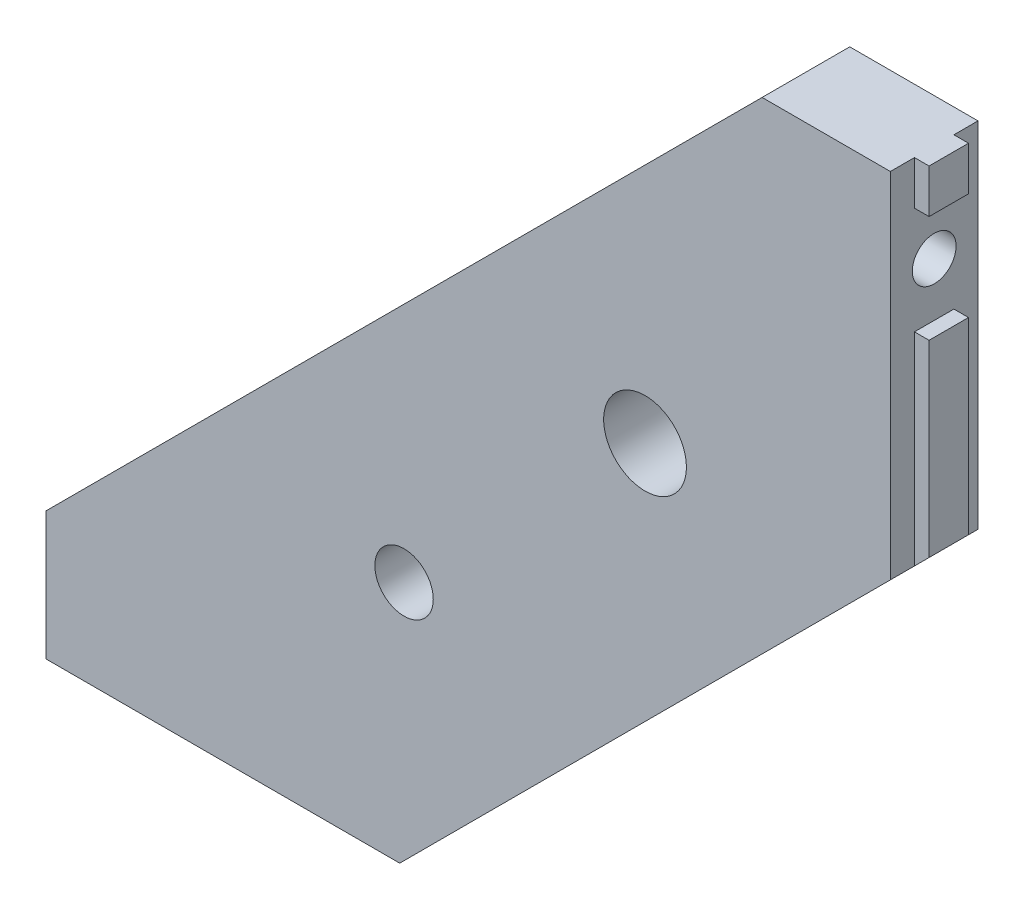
ISO-10303-21;
HEADER;
FILE_DESCRIPTION(('STEP AP214'),'2;1');
FILE_NAME('part.step','',(''),(''),'','','');
FILE_SCHEMA(('AUTOMOTIVE_DESIGN { 1 0 10303 214 1 1 1 1 }'));
ENDSEC;
DATA;
#1=APPLICATION_CONTEXT('core data for automotive mechanical design processes');
#2=APPLICATION_PROTOCOL_DEFINITION('international standard','automotive_design',2000,#1);
#3=PRODUCT_CONTEXT('',#1,'mechanical');
#4=PRODUCT('Part','Part','',(#3));
#5=PRODUCT_RELATED_PRODUCT_CATEGORY('part','',(#4));
#6=PRODUCT_DEFINITION_FORMATION('','',#4);
#7=PRODUCT_DEFINITION_CONTEXT('part definition',#1,'design');
#8=PRODUCT_DEFINITION('design','',#6,#7);
#9=PRODUCT_DEFINITION_SHAPE('','',#8);
#10=(LENGTH_UNIT() NAMED_UNIT(*) SI_UNIT(.MILLI.,.METRE.));
#11=(NAMED_UNIT(*) PLANE_ANGLE_UNIT() SI_UNIT($,.RADIAN.));
#12=(NAMED_UNIT(*) SI_UNIT($,.STERADIAN.) SOLID_ANGLE_UNIT());
#13=UNCERTAINTY_MEASURE_WITH_UNIT(LENGTH_MEASURE(1.E-05),#10,'distance_accuracy_value','');
#14=(GEOMETRIC_REPRESENTATION_CONTEXT(3) GLOBAL_UNCERTAINTY_ASSIGNED_CONTEXT((#13)) GLOBAL_UNIT_ASSIGNED_CONTEXT((#10,
#11,#12)) REPRESENTATION_CONTEXT('',''));
#15=CARTESIAN_POINT('',(0.,0.,0.));
#16=DIRECTION('',(0.,0.,1.));
#17=DIRECTION('',(1.,0.,0.));
#18=AXIS2_PLACEMENT_3D('',#15,#16,#17);
#19=CARTESIAN_POINT('',(-30.9999999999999,148.773141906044,-7.64999999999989));
#20=DIRECTION('',(-1.,0.,0.));
#21=DIRECTION('',(0.,0.,1.));
#22=AXIS2_PLACEMENT_3D('',#19,#20,#21);
#23=PLANE('',#22);
#24=CARTESIAN_POINT('',(-30.9999999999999,156.423141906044,1.19792979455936E-13));
#25=DIRECTION('',(-1.,0.,0.));
#26=DIRECTION('',(0.,0.,1.));
#27=AXIS2_PLACEMENT_3D('',#24,#25,#26);
#28=CIRCLE('',#27,4.5);
#29=CARTESIAN_POINT('',(-30.9999999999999,156.423141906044,4.50000000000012));
#30=VERTEX_POINT('',#29);
#31=EDGE_CURVE('E19',#30,#30,#28,.F.);
#32=ORIENTED_EDGE('',*,*,#31,.T.);
#33=EDGE_LOOP('',(#32));
#34=FACE_BOUND('',#33,.T.);
#35=CARTESIAN_POINT('',(-30.9999999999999,156.423141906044,1.16396186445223E-13));
#36=DIRECTION('',(-1.,0.,0.));
#37=DIRECTION('',(0.,0.,1.));
#38=AXIS2_PLACEMENT_3D('',#35,#36,#37);
#39=CIRCLE('',#38,7.5);
#40=CARTESIAN_POINT('',(-30.9999999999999,156.423141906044,7.50000000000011));
#41=VERTEX_POINT('',#40);
#42=EDGE_CURVE('E227',#41,#41,#39,.T.);
#43=ORIENTED_EDGE('',*,*,#42,.T.);
#44=EDGE_LOOP('',(#43));
#45=FACE_BOUND('',#44,.T.);
#46=ADVANCED_FACE('F15',(#34,#45),#23,.T.);
#47=CARTESIAN_POINT('',(-156.423141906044,31.,0.));
#48=DIRECTION('',(0.,1.,0.));
#49=DIRECTION('',(0.,0.,1.));
#50=AXIS2_PLACEMENT_3D('',#47,#48,#49);
#51=PLANE('',#50);
#52=CARTESIAN_POINT('',(-156.423141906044,31.,0.));
#53=DIRECTION('',(0.,1.,0.));
#54=DIRECTION('',(0.,0.,1.));
#55=AXIS2_PLACEMENT_3D('',#52,#53,#54);
#56=CIRCLE('',#55,4.5);
#57=CARTESIAN_POINT('',(-156.423141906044,31.,4.5));
#58=VERTEX_POINT('',#57);
#59=EDGE_CURVE('E219',#58,#58,#56,.F.);
#60=ORIENTED_EDGE('',*,*,#59,.T.);
#61=EDGE_LOOP('',(#60));
#62=FACE_BOUND('',#61,.T.);
#63=CARTESIAN_POINT('',(-156.423141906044,31.,0.));
#64=DIRECTION('',(0.,1.,0.));
#65=DIRECTION('',(-1.,0.,0.));
#66=AXIS2_PLACEMENT_3D('',#63,#64,#65);
#67=CIRCLE('',#66,7.5);
#68=CARTESIAN_POINT('',(-163.923141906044,31.,0.));
#69=VERTEX_POINT('',#68);
#70=EDGE_CURVE('E224',#69,#69,#67,.T.);
#71=ORIENTED_EDGE('',*,*,#70,.T.);
#72=EDGE_LOOP('',(#71));
#73=FACE_BOUND('',#72,.T.);
#74=ADVANCED_FACE('F461',(#62,#73),#51,.T.);
#75=CARTESIAN_POINT('',(-2.99999999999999,145.423141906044,-4.04999999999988));
#76=DIRECTION('',(0.,-1.,0.));
#77=DIRECTION('',(0.,0.,-1.));
#78=AXIS2_PLACEMENT_3D('',#75,#76,#77);
#79=PLANE('',#78);
#80=DIRECTION('',(1.,0.,0.));
#81=VECTOR('',#80,1.);
#82=CARTESIAN_POINT('',(-3.,145.423141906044,-4.05));
#83=LINE('',#82,#81);
#84=CARTESIAN_POINT('',(0.,145.423141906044,-4.04999999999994));
#85=VERTEX_POINT('',#84);
#86=CARTESIAN_POINT('',(-2.99999999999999,145.423141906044,-4.04999999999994));
#87=VERTEX_POINT('',#86);
#88=EDGE_CURVE('E222',#85,#87,#83,.F.);
#89=ORIENTED_EDGE('',*,*,#88,.T.);
#90=DIRECTION('',(0.,0.,1.));
#91=VECTOR('',#90,1.);
#92=CARTESIAN_POINT('',(-3.,145.423141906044,-9.));
#93=LINE('',#92,#91);
#94=CARTESIAN_POINT('',(-3.,145.423141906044,4.05000000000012));
#95=VERTEX_POINT('',#94);
#96=EDGE_CURVE('E265',#87,#95,#93,.T.);
#97=ORIENTED_EDGE('',*,*,#96,.T.);
#98=DIRECTION('',(-1.,0.,0.));
#99=VECTOR('',#98,1.);
#100=CARTESIAN_POINT('',(0.,145.423141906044,4.05));
#101=LINE('',#100,#99);
#102=CARTESIAN_POINT('',(0.,145.423141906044,4.05000000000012));
#103=VERTEX_POINT('',#102);
#104=EDGE_CURVE('E250',#95,#103,#101,.F.);
#105=ORIENTED_EDGE('',*,*,#104,.T.);
#106=DIRECTION('',(0.,0.,-1.));
#107=VECTOR('',#106,1.);
#108=CARTESIAN_POINT('',(0.,145.423141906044,0.));
#109=LINE('',#108,#107);
#110=EDGE_CURVE('E243',#85,#103,#109,.F.);
#111=ORIENTED_EDGE('',*,*,#110,.F.);
#112=EDGE_LOOP('',(#89,#97,#105,#111));
#113=FACE_BOUND('',#112,.T.);
#114=ADVANCED_FACE('F459',(#113),#79,.F.);
#115=CARTESIAN_POINT('',(-2.99999999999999,167.423141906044,4.05000000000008));
#116=DIRECTION('',(0.,1.,0.));
#117=DIRECTION('',(0.,0.,1.));
#118=AXIS2_PLACEMENT_3D('',#115,#116,#117);
#119=PLANE('',#118);
#120=DIRECTION('',(-1.,0.,0.));
#121=VECTOR('',#120,1.);
#122=CARTESIAN_POINT('',(0.,167.423141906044,4.05));
#123=LINE('',#122,#121);
#124=CARTESIAN_POINT('',(0.,167.423141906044,4.05000000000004));
#125=VERTEX_POINT('',#124);
#126=CARTESIAN_POINT('',(-2.99999999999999,167.423141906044,4.05000000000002));
#127=VERTEX_POINT('',#126);
#128=EDGE_CURVE('E167',#125,#127,#123,.T.);
#129=ORIENTED_EDGE('',*,*,#128,.T.);
#130=DIRECTION('',(0.,0.,1.));
#131=VECTOR('',#130,1.);
#132=CARTESIAN_POINT('',(-3.,167.423141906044,-9.));
#133=LINE('',#132,#131);
#134=CARTESIAN_POINT('',(-2.99999999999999,167.423141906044,-4.04999999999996));
#135=VERTEX_POINT('',#134);
#136=EDGE_CURVE('E270',#127,#135,#133,.F.);
#137=ORIENTED_EDGE('',*,*,#136,.T.);
#138=DIRECTION('',(1.,0.,0.));
#139=VECTOR('',#138,1.);
#140=CARTESIAN_POINT('',(-3.,167.423141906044,-4.05));
#141=LINE('',#140,#139);
#142=CARTESIAN_POINT('',(0.,167.423141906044,-4.05));
#143=VERTEX_POINT('',#142);
#144=EDGE_CURVE('E170',#135,#143,#141,.T.);
#145=ORIENTED_EDGE('',*,*,#144,.T.);
#146=DIRECTION('',(0.,0.,-1.));
#147=VECTOR('',#146,1.);
#148=CARTESIAN_POINT('',(0.,167.423141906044,0.));
#149=LINE('',#148,#147);
#150=EDGE_CURVE('E162',#125,#143,#149,.T.);
#151=ORIENTED_EDGE('',*,*,#150,.F.);
#152=EDGE_LOOP('',(#129,#137,#145,#151));
#153=FACE_BOUND('',#152,.T.);
#154=ADVANCED_FACE('F166',(#153),#119,.F.);
#155=CARTESIAN_POINT('',(-2.99999999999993,156.423141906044,1.4677756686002E-13));
#156=DIRECTION('',(-1.,0.,0.));
#157=DIRECTION('',(0.,0.,1.));
#158=AXIS2_PLACEMENT_3D('',#155,#156,#157);
#159=CYLINDRICAL_SURFACE('',#158,4.5);
#160=ORIENTED_EDGE('',*,*,#31,.F.);
#161=EDGE_LOOP('',(#160));
#162=FACE_BOUND('',#161,.T.);
#163=CARTESIAN_POINT('',(-3.,156.423141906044,1.4677756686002E-13));
#164=DIRECTION('',(-1.,0.,0.));
#165=DIRECTION('',(0.,0.,1.));
#166=AXIS2_PLACEMENT_3D('',#163,#164,#165);
#167=CIRCLE('',#166,4.5);
#168=CARTESIAN_POINT('',(-3.,156.423141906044,4.50000000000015));
#169=VERTEX_POINT('',#168);
#170=EDGE_CURVE('E214',#169,#169,#167,.F.);
#171=ORIENTED_EDGE('',*,*,#170,.T.);
#172=EDGE_LOOP('',(#171));
#173=FACE_BOUND('',#172,.T.);
#174=ADVANCED_FACE('F467',(#162,#173),#159,.F.);
#175=CARTESIAN_POINT('',(0.,106.773123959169,4.05));
#176=DIRECTION('',(0.,0.,-1.));
#177=DIRECTION('',(-1.,0.,0.));
#178=AXIS2_PLACEMENT_3D('',#175,#176,#177);
#179=PLANE('',#178);
#180=DIRECTION('',(0.,1.,0.));
#181=VECTOR('',#180,1.);
#182=CARTESIAN_POINT('',(0.,176.423141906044,4.05));
#183=LINE('',#182,#181);
#184=CARTESIAN_POINT('',(0.,176.423141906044,4.05));
#185=VERTEX_POINT('',#184);
#186=EDGE_CURVE('E172',#185,#125,#183,.F.);
#187=ORIENTED_EDGE('',*,*,#186,.F.);
#188=DIRECTION('',(1.,0.,0.));
#189=VECTOR('',#188,1.);
#190=CARTESIAN_POINT('',(-29.3449314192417,176.423141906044,4.05));
#191=LINE('',#190,#189);
#192=CARTESIAN_POINT('',(-2.99999999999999,176.423141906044,4.05));
#193=VERTEX_POINT('',#192);
#194=EDGE_CURVE('E285',#193,#185,#191,.T.);
#195=ORIENTED_EDGE('',*,*,#194,.F.);
#196=DIRECTION('',(0.,1.,0.));
#197=VECTOR('',#196,1.);
#198=CARTESIAN_POINT('',(-3.,106.773123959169,4.05));
#199=LINE('',#198,#197);
#200=EDGE_CURVE('E178',#193,#127,#199,.F.);
#201=ORIENTED_EDGE('',*,*,#200,.T.);
#202=ORIENTED_EDGE('',*,*,#128,.F.);
#203=EDGE_LOOP('',(#187,#195,#201,#202));
#204=FACE_BOUND('',#203,.T.);
#205=ADVANCED_FACE('F175',(#204),#179,.F.);
#206=CARTESIAN_POINT('',(0.,176.423141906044,0.));
#207=DIRECTION('',(1.,0.,0.));
#208=DIRECTION('',(0.,0.,-1.));
#209=AXIS2_PLACEMENT_3D('',#206,#207,#208);
#210=PLANE('',#209);
#211=DIRECTION('',(0.,0.,1.));
#212=VECTOR('',#211,1.);
#213=CARTESIAN_POINT('',(0.,176.423141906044,0.));
#214=LINE('',#213,#212);
#215=CARTESIAN_POINT('',(0.,176.423141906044,-4.05));
#216=VERTEX_POINT('',#215);
#217=EDGE_CURVE('E183',#185,#216,#214,.F.);
#218=ORIENTED_EDGE('',*,*,#217,.F.);
#219=ORIENTED_EDGE('',*,*,#186,.T.);
#220=ORIENTED_EDGE('',*,*,#150,.T.);
#221=DIRECTION('',(0.,1.,0.));
#222=VECTOR('',#221,1.);
#223=CARTESIAN_POINT('',(0.,106.773123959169,-4.05));
#224=LINE('',#223,#222);
#225=EDGE_CURVE('E185',#143,#216,#224,.T.);
#226=ORIENTED_EDGE('',*,*,#225,.T.);
#227=EDGE_LOOP('',(#218,#219,#220,#226));
#228=FACE_BOUND('',#227,.T.);
#229=ADVANCED_FACE('F181',(#228),#210,.T.);
#230=CARTESIAN_POINT('',(-3.,106.773123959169,-4.05));
#231=DIRECTION('',(0.,0.,1.));
#232=DIRECTION('',(1.,0.,0.));
#233=AXIS2_PLACEMENT_3D('',#230,#231,#232);
#234=PLANE('',#233);
#235=DIRECTION('',(0.,1.,0.));
#236=VECTOR('',#235,1.);
#237=CARTESIAN_POINT('',(-3.,106.773123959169,-4.04999999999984));
#238=LINE('',#237,#236);
#239=CARTESIAN_POINT('',(-2.99999999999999,176.423141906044,-4.04999999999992));
#240=VERTEX_POINT('',#239);
#241=EDGE_CURVE('E272',#135,#240,#238,.T.);
#242=ORIENTED_EDGE('',*,*,#241,.T.);
#243=DIRECTION('',(1.,0.,0.));
#244=VECTOR('',#243,1.);
#245=CARTESIAN_POINT('',(-29.3449314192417,176.423141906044,-4.05));
#246=LINE('',#245,#244);
#247=EDGE_CURVE('E288',#216,#240,#246,.F.);
#248=ORIENTED_EDGE('',*,*,#247,.F.);
#249=ORIENTED_EDGE('',*,*,#225,.F.);
#250=ORIENTED_EDGE('',*,*,#144,.F.);
#251=EDGE_LOOP('',(#242,#248,#249,#250));
#252=FACE_BOUND('',#251,.T.);
#253=ADVANCED_FACE('F482',(#252),#234,.F.);
#254=CARTESIAN_POINT('',(-30.9999999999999,156.423141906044,1.16396186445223E-13));
#255=DIRECTION('',(-1.,0.,0.));
#256=DIRECTION('',(0.,0.,1.));
#257=AXIS2_PLACEMENT_3D('',#254,#255,#256);
#258=CYLINDRICAL_SURFACE('',#257,7.5);
#259=ORIENTED_EDGE('',*,*,#42,.F.);
#260=EDGE_LOOP('',(#259));
#261=FACE_BOUND('',#260,.T.);
#262=CARTESIAN_POINT('',(-49.3449314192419,156.423141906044,0.));
#263=DIRECTION('',(-0.707106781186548,0.707106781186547,0.));
#264=DIRECTION('',(-0.707106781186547,-0.707106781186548,0.));
#265=AXIS2_PLACEMENT_3D('',#262,#263,#264);
#266=ELLIPSE('',#265,10.6066017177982,7.5);
#267=CARTESIAN_POINT('',(-56.8449314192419,148.923141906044,0.));
#268=VERTEX_POINT('',#267);
#269=EDGE_CURVE('E210',#268,#268,#266,.F.);
#270=ORIENTED_EDGE('',*,*,#269,.F.);
#271=EDGE_LOOP('',(#270));
#272=FACE_BOUND('',#271,.T.);
#273=ADVANCED_FACE('F479',(#261,#272),#258,.F.);
#274=CARTESIAN_POINT('',(-156.423141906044,31.,0.));
#275=DIRECTION('',(0.,1.,0.));
#276=DIRECTION('',(-1.,0.,0.));
#277=AXIS2_PLACEMENT_3D('',#274,#275,#276);
#278=CYLINDRICAL_SURFACE('',#277,7.5);
#279=ORIENTED_EDGE('',*,*,#70,.F.);
#280=EDGE_LOOP('',(#279));
#281=FACE_BOUND('',#280,.T.);
#282=CARTESIAN_POINT('',(-156.423141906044,49.3449314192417,0.));
#283=DIRECTION('',(-0.707106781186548,0.707106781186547,0.));
#284=DIRECTION('',(0.707106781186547,0.707106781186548,0.));
#285=AXIS2_PLACEMENT_3D('',#282,#283,#284);
#286=ELLIPSE('',#285,10.6066017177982,7.5);
#287=CARTESIAN_POINT('',(-148.923141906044,56.8449314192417,0.));
#288=VERTEX_POINT('',#287);
#289=EDGE_CURVE('E206',#288,#288,#286,.F.);
#290=ORIENTED_EDGE('',*,*,#289,.F.);
#291=EDGE_LOOP('',(#290));
#292=FACE_BOUND('',#291,.T.);
#293=ADVANCED_FACE('F481',(#281,#292),#278,.F.);
#294=CARTESIAN_POINT('',(-106.773123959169,0.,0.));
#295=DIRECTION('',(0.,-1.,0.));
#296=DIRECTION('',(0.,0.,-1.));
#297=AXIS2_PLACEMENT_3D('',#294,#295,#296);
#298=PLANE('',#297);
#299=DIRECTION('',(0.,0.,1.));
#300=VECTOR('',#299,1.);
#301=CARTESIAN_POINT('',(-176.423141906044,0.,0.));
#302=LINE('',#301,#300);
#303=CARTESIAN_POINT('',(-176.423141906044,0.,-4.05));
#304=VERTEX_POINT('',#303);
#305=CARTESIAN_POINT('',(-176.423141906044,0.,4.04999999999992));
#306=VERTEX_POINT('',#305);
#307=EDGE_CURVE('E297',#304,#306,#302,.T.);
#308=ORIENTED_EDGE('',*,*,#307,.F.);
#309=DIRECTION('',(1.,0.,0.));
#310=VECTOR('',#309,1.);
#311=CARTESIAN_POINT('',(-106.773123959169,0.,-4.05));
#312=LINE('',#311,#310);
#313=CARTESIAN_POINT('',(-167.423141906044,0.,-4.05000000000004));
#314=VERTEX_POINT('',#313);
#315=EDGE_CURVE('E226',#304,#314,#312,.T.);
#316=ORIENTED_EDGE('',*,*,#315,.T.);
#317=DIRECTION('',(0.,0.,1.));
#318=VECTOR('',#317,1.);
#319=CARTESIAN_POINT('',(-167.423141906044,0.,0.));
#320=LINE('',#319,#318);
#321=CARTESIAN_POINT('',(-167.423141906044,0.,4.04999999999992));
#322=VERTEX_POINT('',#321);
#323=EDGE_CURVE('E236',#314,#322,#320,.T.);
#324=ORIENTED_EDGE('',*,*,#323,.T.);
#325=DIRECTION('',(-1.,0.,0.));
#326=VECTOR('',#325,1.);
#327=CARTESIAN_POINT('',(-106.773123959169,0.,4.05));
#328=LINE('',#327,#326);
#329=EDGE_CURVE('E238',#322,#306,#328,.T.);
#330=ORIENTED_EDGE('',*,*,#329,.T.);
#331=EDGE_LOOP('',(#308,#316,#324,#330));
#332=FACE_BOUND('',#331,.T.);
#333=ADVANCED_FACE('F487',(#332),#298,.T.);
#334=CARTESIAN_POINT('',(-145.423141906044,0.,4.05000000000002));
#335=DIRECTION('',(1.,0.,0.));
#336=DIRECTION('',(0.,0.,-1.));
#337=AXIS2_PLACEMENT_3D('',#334,#335,#336);
#338=PLANE('',#337);
#339=DIRECTION('',(0.,1.,0.));
#340=VECTOR('',#339,1.);
#341=CARTESIAN_POINT('',(-145.423141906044,3.00000000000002,4.05));
#342=LINE('',#341,#340);
#343=CARTESIAN_POINT('',(-145.423141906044,0.,4.05000000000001));
#344=VERTEX_POINT('',#343);
#345=CARTESIAN_POINT('',(-145.423141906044,3.00000000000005,4.05000000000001));
#346=VERTEX_POINT('',#345);
#347=EDGE_CURVE('E253',#344,#346,#342,.T.);
#348=ORIENTED_EDGE('',*,*,#347,.T.);
#349=DIRECTION('',(0.,0.,1.));
#350=VECTOR('',#349,1.);
#351=CARTESIAN_POINT('',(-145.423141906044,3.00000000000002,9.));
#352=LINE('',#351,#350);
#353=CARTESIAN_POINT('',(-145.423141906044,3.00000000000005,-4.05000000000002));
#354=VERTEX_POINT('',#353);
#355=EDGE_CURVE('E309',#346,#354,#352,.F.);
#356=ORIENTED_EDGE('',*,*,#355,.T.);
#357=DIRECTION('',(0.,1.,0.));
#358=VECTOR('',#357,1.);
#359=CARTESIAN_POINT('',(-145.423141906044,0.,-4.05));
#360=LINE('',#359,#358);
#361=CARTESIAN_POINT('',(-145.423141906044,0.,-4.05000000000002));
#362=VERTEX_POINT('',#361);
#363=EDGE_CURVE('E262',#354,#362,#360,.F.);
#364=ORIENTED_EDGE('',*,*,#363,.T.);
#365=DIRECTION('',(0.,0.,-1.));
#366=VECTOR('',#365,1.);
#367=CARTESIAN_POINT('',(-145.423141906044,0.,0.));
#368=LINE('',#367,#366);
#369=EDGE_CURVE('E255',#344,#362,#368,.T.);
#370=ORIENTED_EDGE('',*,*,#369,.F.);
#371=EDGE_LOOP('',(#348,#356,#364,#370));
#372=FACE_BOUND('',#371,.T.);
#373=ADVANCED_FACE('F484',(#372),#338,.F.);
#374=CARTESIAN_POINT('',(-106.773123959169,0.,-4.05));
#375=DIRECTION('',(0.,0.,1.));
#376=DIRECTION('',(1.,0.,0.));
#377=AXIS2_PLACEMENT_3D('',#374,#375,#376);
#378=PLANE('',#377);
#379=ORIENTED_EDGE('',*,*,#315,.F.);
#380=DIRECTION('',(0.,1.,0.));
#381=VECTOR('',#380,1.);
#382=CARTESIAN_POINT('',(-176.423141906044,0.,-4.05));
#383=LINE('',#382,#381);
#384=CARTESIAN_POINT('',(-176.423141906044,3.00000000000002,-4.05));
#385=VERTEX_POINT('',#384);
#386=EDGE_CURVE('E209',#385,#304,#383,.F.);
#387=ORIENTED_EDGE('',*,*,#386,.F.);
#388=DIRECTION('',(1.,0.,0.));
#389=VECTOR('',#388,1.);
#390=CARTESIAN_POINT('',(-106.773123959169,3.00000000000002,-4.05));
#391=LINE('',#390,#389);
#392=CARTESIAN_POINT('',(-167.423141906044,3.00000000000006,-4.05000000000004));
#393=VERTEX_POINT('',#392);
#394=EDGE_CURVE('E318',#385,#393,#391,.T.);
#395=ORIENTED_EDGE('',*,*,#394,.T.);
#396=DIRECTION('',(0.,-1.,0.));
#397=VECTOR('',#396,1.);
#398=CARTESIAN_POINT('',(-167.423141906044,1.50000000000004,-4.05000000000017));
#399=LINE('',#398,#397);
#400=EDGE_CURVE('E233',#393,#314,#399,.T.);
#401=ORIENTED_EDGE('',*,*,#400,.T.);
#402=EDGE_LOOP('',(#379,#387,#395,#401));
#403=FACE_BOUND('',#402,.T.);
#404=ADVANCED_FACE('F486',(#403),#378,.F.);
#405=CARTESIAN_POINT('',(-167.423141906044,0.,-4.05000000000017));
#406=DIRECTION('',(-1.,0.,0.));
#407=DIRECTION('',(0.,0.,1.));
#408=AXIS2_PLACEMENT_3D('',#405,#406,#407);
#409=PLANE('',#408);
#410=ORIENTED_EDGE('',*,*,#400,.F.);
#411=DIRECTION('',(0.,0.,1.));
#412=VECTOR('',#411,1.);
#413=CARTESIAN_POINT('',(-167.423141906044,3.00000000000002,9.));
#414=LINE('',#413,#412);
#415=CARTESIAN_POINT('',(-167.423141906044,3.00000000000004,4.04999999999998));
#416=VERTEX_POINT('',#415);
#417=EDGE_CURVE('E320',#393,#416,#414,.T.);
#418=ORIENTED_EDGE('',*,*,#417,.T.);
#419=DIRECTION('',(0.,1.,0.));
#420=VECTOR('',#419,1.);
#421=CARTESIAN_POINT('',(-167.423141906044,3.00000000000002,4.05));
#422=LINE('',#421,#420);
#423=EDGE_CURVE('E223',#416,#322,#422,.F.);
#424=ORIENTED_EDGE('',*,*,#423,.T.);
#425=ORIENTED_EDGE('',*,*,#323,.F.);
#426=EDGE_LOOP('',(#410,#418,#424,#425));
#427=FACE_BOUND('',#426,.T.);
#428=ADVANCED_FACE('F17',(#427),#409,.F.);
#429=CARTESIAN_POINT('',(-106.773123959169,3.00000000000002,4.05));
#430=DIRECTION('',(0.,0.,-1.));
#431=DIRECTION('',(-1.,0.,0.));
#432=AXIS2_PLACEMENT_3D('',#429,#430,#431);
#433=PLANE('',#432);
#434=DIRECTION('',(1.,0.,0.));
#435=VECTOR('',#434,1.);
#436=CARTESIAN_POINT('',(-106.773123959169,3.00000000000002,4.04999999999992));
#437=LINE('',#436,#435);
#438=CARTESIAN_POINT('',(-176.423141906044,3.,4.04999999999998));
#439=VERTEX_POINT('',#438);
#440=EDGE_CURVE('E322',#416,#439,#437,.F.);
#441=ORIENTED_EDGE('',*,*,#440,.T.);
#442=DIRECTION('',(0.,1.,0.));
#443=VECTOR('',#442,1.);
#444=CARTESIAN_POINT('',(-176.423141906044,0.,4.05));
#445=LINE('',#444,#443);
#446=EDGE_CURVE('E300',#306,#439,#445,.T.);
#447=ORIENTED_EDGE('',*,*,#446,.F.);
#448=ORIENTED_EDGE('',*,*,#329,.F.);
#449=ORIENTED_EDGE('',*,*,#423,.F.);
#450=EDGE_LOOP('',(#441,#447,#448,#449));
#451=FACE_BOUND('',#450,.T.);
#452=ADVANCED_FACE('F526',(#451),#433,.F.);
#453=CARTESIAN_POINT('',(-156.423141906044,0.,0.));
#454=DIRECTION('',(0.,1.,0.));
#455=DIRECTION('',(0.,0.,1.));
#456=AXIS2_PLACEMENT_3D('',#453,#454,#455);
#457=CYLINDRICAL_SURFACE('',#456,4.5);
#458=ORIENTED_EDGE('',*,*,#59,.F.);
#459=EDGE_LOOP('',(#458));
#460=FACE_BOUND('',#459,.T.);
#461=CARTESIAN_POINT('',(-156.423141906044,3.,0.));
#462=DIRECTION('',(0.,1.,0.));
#463=DIRECTION('',(0.,0.,1.));
#464=AXIS2_PLACEMENT_3D('',#461,#462,#463);
#465=CIRCLE('',#464,4.5);
#466=CARTESIAN_POINT('',(-156.423141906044,3.,4.5));
#467=VERTEX_POINT('',#466);
#468=EDGE_CURVE('E201',#467,#467,#465,.F.);
#469=ORIENTED_EDGE('',*,*,#468,.T.);
#470=EDGE_LOOP('',(#469));
#471=FACE_BOUND('',#470,.T.);
#472=ADVANCED_FACE('F523',(#460,#471),#457,.F.);
#473=CARTESIAN_POINT('',(-3.,106.773123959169,-4.05));
#474=DIRECTION('',(0.,0.,1.));
#475=DIRECTION('',(1.,0.,0.));
#476=AXIS2_PLACEMENT_3D('',#473,#474,#475);
#477=PLANE('',#476);
#478=DIRECTION('',(0.,1.,0.));
#479=VECTOR('',#478,1.);
#480=CARTESIAN_POINT('',(0.,176.423141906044,-4.05));
#481=LINE('',#480,#479);
#482=CARTESIAN_POINT('',(0.,106.773123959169,-4.05));
#483=VERTEX_POINT('',#482);
#484=EDGE_CURVE('E245',#483,#85,#481,.T.);
#485=ORIENTED_EDGE('',*,*,#484,.F.);
#486=DIRECTION('',(0.707106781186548,0.707106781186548,0.));
#487=VECTOR('',#486,1.);
#488=CARTESIAN_POINT('',(0.,106.773123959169,-4.05));
#489=LINE('',#488,#487);
#490=CARTESIAN_POINT('',(-3.,103.773123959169,-4.05));
#491=VERTEX_POINT('',#490);
#492=EDGE_CURVE('E330',#491,#483,#489,.T.);
#493=ORIENTED_EDGE('',*,*,#492,.F.);
#494=DIRECTION('',(0.,1.,0.));
#495=VECTOR('',#494,1.);
#496=CARTESIAN_POINT('',(-3.,106.773123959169,-4.05));
#497=LINE('',#496,#495);
#498=EDGE_CURVE('E218',#491,#87,#497,.T.);
#499=ORIENTED_EDGE('',*,*,#498,.T.);
#500=ORIENTED_EDGE('',*,*,#88,.F.);
#501=EDGE_LOOP('',(#485,#493,#499,#500));
#502=FACE_BOUND('',#501,.T.);
#503=ADVANCED_FACE('F450',(#502),#477,.F.);
#504=CARTESIAN_POINT('',(0.,176.423141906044,0.));
#505=DIRECTION('',(1.,0.,0.));
#506=DIRECTION('',(0.,0.,-1.));
#507=AXIS2_PLACEMENT_3D('',#504,#505,#506);
#508=PLANE('',#507);
#509=DIRECTION('',(0.,0.,1.));
#510=VECTOR('',#509,1.);
#511=CARTESIAN_POINT('',(0.,106.773123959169,0.));
#512=LINE('',#511,#510);
#513=CARTESIAN_POINT('',(0.,106.773123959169,4.05000000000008));
#514=VERTEX_POINT('',#513);
#515=EDGE_CURVE('E333',#483,#514,#512,.T.);
#516=ORIENTED_EDGE('',*,*,#515,.F.);
#517=ORIENTED_EDGE('',*,*,#484,.T.);
#518=ORIENTED_EDGE('',*,*,#110,.T.);
#519=DIRECTION('',(0.,1.,0.));
#520=VECTOR('',#519,1.);
#521=CARTESIAN_POINT('',(0.,106.773123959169,4.05));
#522=LINE('',#521,#520);
#523=EDGE_CURVE('E248',#103,#514,#522,.F.);
#524=ORIENTED_EDGE('',*,*,#523,.T.);
#525=EDGE_LOOP('',(#516,#517,#518,#524));
#526=FACE_BOUND('',#525,.T.);
#527=ADVANCED_FACE('F453',(#526),#508,.T.);
#528=CARTESIAN_POINT('',(0.,106.773123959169,4.05));
#529=DIRECTION('',(0.,0.,-1.));
#530=DIRECTION('',(-1.,0.,0.));
#531=AXIS2_PLACEMENT_3D('',#528,#529,#530);
#532=PLANE('',#531);
#533=DIRECTION('',(0.,1.,0.));
#534=VECTOR('',#533,1.);
#535=CARTESIAN_POINT('',(-3.,106.773123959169,4.05000000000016));
#536=LINE('',#535,#534);
#537=CARTESIAN_POINT('',(-3.,103.773123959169,4.05000000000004));
#538=VERTEX_POINT('',#537);
#539=EDGE_CURVE('E267',#95,#538,#536,.F.);
#540=ORIENTED_EDGE('',*,*,#539,.T.);
#541=DIRECTION('',(0.707106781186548,0.707106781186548,0.));
#542=VECTOR('',#541,1.);
#543=CARTESIAN_POINT('',(0.,106.773123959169,4.05));
#544=LINE('',#543,#542);
#545=EDGE_CURVE('E336',#514,#538,#544,.F.);
#546=ORIENTED_EDGE('',*,*,#545,.F.);
#547=ORIENTED_EDGE('',*,*,#523,.F.);
#548=ORIENTED_EDGE('',*,*,#104,.F.);
#549=EDGE_LOOP('',(#540,#546,#547,#548));
#550=FACE_BOUND('',#549,.T.);
#551=ADVANCED_FACE('F457',(#550),#532,.F.);
#552=CARTESIAN_POINT('',(-106.773123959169,3.00000000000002,4.05));
#553=DIRECTION('',(0.,0.,-1.));
#554=DIRECTION('',(-1.,0.,0.));
#555=AXIS2_PLACEMENT_3D('',#552,#553,#554);
#556=PLANE('',#555);
#557=DIRECTION('',(1.,0.,0.));
#558=VECTOR('',#557,1.);
#559=CARTESIAN_POINT('',(-106.773123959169,0.,4.05));
#560=LINE('',#559,#558);
#561=CARTESIAN_POINT('',(-106.773123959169,0.,4.05));
#562=VERTEX_POINT('',#561);
#563=EDGE_CURVE('E257',#562,#344,#560,.F.);
#564=ORIENTED_EDGE('',*,*,#563,.F.);
#565=DIRECTION('',(0.707106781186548,0.707106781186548,0.));
#566=VECTOR('',#565,1.);
#567=CARTESIAN_POINT('',(0.,106.773123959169,4.05));
#568=LINE('',#567,#566);
#569=CARTESIAN_POINT('',(-103.773123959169,3.00000000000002,4.05));
#570=VERTEX_POINT('',#569);
#571=EDGE_CURVE('E343',#570,#562,#568,.F.);
#572=ORIENTED_EDGE('',*,*,#571,.F.);
#573=DIRECTION('',(1.,0.,0.));
#574=VECTOR('',#573,1.);
#575=CARTESIAN_POINT('',(-106.773123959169,3.00000000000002,4.05));
#576=LINE('',#575,#574);
#577=EDGE_CURVE('E205',#570,#346,#576,.F.);
#578=ORIENTED_EDGE('',*,*,#577,.T.);
#579=ORIENTED_EDGE('',*,*,#347,.F.);
#580=EDGE_LOOP('',(#564,#572,#578,#579));
#581=FACE_BOUND('',#580,.T.);
#582=ADVANCED_FACE('F501',(#581),#556,.F.);
#583=CARTESIAN_POINT('',(-106.773123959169,0.,0.));
#584=DIRECTION('',(0.,-1.,0.));
#585=DIRECTION('',(0.,0.,-1.));
#586=AXIS2_PLACEMENT_3D('',#583,#584,#585);
#587=PLANE('',#586);
#588=DIRECTION('',(0.,0.,1.));
#589=VECTOR('',#588,1.);
#590=CARTESIAN_POINT('',(-106.773123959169,0.,0.));
#591=LINE('',#590,#589);
#592=CARTESIAN_POINT('',(-106.773123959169,0.,-4.05000000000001));
#593=VERTEX_POINT('',#592);
#594=EDGE_CURVE('E346',#562,#593,#591,.F.);
#595=ORIENTED_EDGE('',*,*,#594,.F.);
#596=ORIENTED_EDGE('',*,*,#563,.T.);
#597=ORIENTED_EDGE('',*,*,#369,.T.);
#598=DIRECTION('',(1.,0.,0.));
#599=VECTOR('',#598,1.);
#600=CARTESIAN_POINT('',(-106.773123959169,0.,-4.05));
#601=LINE('',#600,#599);
#602=EDGE_CURVE('E260',#362,#593,#601,.T.);
#603=ORIENTED_EDGE('',*,*,#602,.T.);
#604=EDGE_LOOP('',(#595,#596,#597,#603));
#605=FACE_BOUND('',#604,.T.);
#606=ADVANCED_FACE('F504',(#605),#587,.T.);
#607=CARTESIAN_POINT('',(-106.773123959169,0.,-4.05));
#608=DIRECTION('',(0.,0.,1.));
#609=DIRECTION('',(1.,0.,0.));
#610=AXIS2_PLACEMENT_3D('',#607,#608,#609);
#611=PLANE('',#610);
#612=DIRECTION('',(1.,0.,0.));
#613=VECTOR('',#612,1.);
#614=CARTESIAN_POINT('',(-106.773123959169,3.00000000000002,-4.05000000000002));
#615=LINE('',#614,#613);
#616=CARTESIAN_POINT('',(-103.773123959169,3.00000000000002,-4.05000000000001));
#617=VERTEX_POINT('',#616);
#618=EDGE_CURVE('E311',#354,#617,#615,.T.);
#619=ORIENTED_EDGE('',*,*,#618,.T.);
#620=DIRECTION('',(0.707106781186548,0.707106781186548,0.));
#621=VECTOR('',#620,1.);
#622=CARTESIAN_POINT('',(0.,106.773123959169,-4.05));
#623=LINE('',#622,#621);
#624=EDGE_CURVE('E349',#593,#617,#623,.T.);
#625=ORIENTED_EDGE('',*,*,#624,.F.);
#626=ORIENTED_EDGE('',*,*,#602,.F.);
#627=ORIENTED_EDGE('',*,*,#363,.F.);
#628=EDGE_LOOP('',(#619,#625,#626,#627));
#629=FACE_BOUND('',#628,.T.);
#630=ADVANCED_FACE('F432',(#629),#611,.F.);
#631=CARTESIAN_POINT('',(-80.6679808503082,80.6679808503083,-9.));
#632=DIRECTION('',(0.,0.,1.));
#633=DIRECTION('',(1.,0.,0.));
#634=AXIS2_PLACEMENT_3D('',#631,#632,#633);
#635=PLANE('',#634);
#636=CARTESIAN_POINT('',(-53.3865619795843,102.884036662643,-9.));
#637=DIRECTION('',(0.,0.,1.));
#638=DIRECTION('',(1.,0.,0.));
#639=AXIS2_PLACEMENT_3D('',#636,#637,#638);
#640=CIRCLE('',#639,8.5);
#641=CARTESIAN_POINT('',(-44.8865619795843,102.884036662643,-9.));
#642=VERTEX_POINT('',#641);
#643=EDGE_CURVE('E193',#642,#642,#640,.T.);
#644=ORIENTED_EDGE('',*,*,#643,.T.);
#645=EDGE_LOOP('',(#644));
#646=FACE_BOUND('',#645,.T.);
#647=CARTESIAN_POINT('',(-102.884036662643,53.3865619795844,-9.));
#648=DIRECTION('',(0.,0.,1.));
#649=DIRECTION('',(1.,0.,0.));
#650=AXIS2_PLACEMENT_3D('',#647,#648,#649);
#651=CIRCLE('',#650,6.);
#652=CARTESIAN_POINT('',(-96.8840366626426,53.3865619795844,-9.));
#653=VERTEX_POINT('',#652);
#654=EDGE_CURVE('E197',#653,#653,#651,.T.);
#655=ORIENTED_EDGE('',*,*,#654,.T.);
#656=EDGE_LOOP('',(#655));
#657=FACE_BOUND('',#656,.T.);
#658=DIRECTION('',(0.707106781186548,0.707106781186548,0.));
#659=VECTOR('',#658,1.);
#660=CARTESIAN_POINT('',(0.,106.773123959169,-9.00000000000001));
#661=LINE('',#660,#659);
#662=CARTESIAN_POINT('',(-103.773123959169,3.00000000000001,-9.));
#663=VERTEX_POINT('',#662);
#664=CARTESIAN_POINT('',(-3.,103.773123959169,-9.));
#665=VERTEX_POINT('',#664);
#666=EDGE_CURVE('E200',#663,#665,#661,.T.);
#667=ORIENTED_EDGE('',*,*,#666,.F.);
#668=DIRECTION('',(1.,0.,0.));
#669=VECTOR('',#668,1.);
#670=CARTESIAN_POINT('',(-106.773123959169,3.00000000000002,-9.));
#671=LINE('',#670,#669);
#672=CARTESIAN_POINT('',(-176.423141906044,3.00000000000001,-9.));
#673=VERTEX_POINT('',#672);
#674=EDGE_CURVE('E313',#663,#673,#671,.F.);
#675=ORIENTED_EDGE('',*,*,#674,.T.);
#676=DIRECTION('',(0.,1.,0.));
#677=VECTOR('',#676,1.);
#678=CARTESIAN_POINT('',(-176.423141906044,0.,-9.));
#679=LINE('',#678,#677);
#680=CARTESIAN_POINT('',(-176.423141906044,29.3449314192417,-9.));
#681=VERTEX_POINT('',#680);
#682=EDGE_CURVE('E306',#681,#673,#679,.F.);
#683=ORIENTED_EDGE('',*,*,#682,.F.);
#684=DIRECTION('',(-0.707106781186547,-0.707106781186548,0.));
#685=VECTOR('',#684,1.);
#686=CARTESIAN_POINT('',(-176.423141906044,29.3449314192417,-9.));
#687=LINE('',#686,#685);
#688=CARTESIAN_POINT('',(-29.3449314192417,176.423141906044,-9.));
#689=VERTEX_POINT('',#688);
#690=EDGE_CURVE('E213',#689,#681,#687,.T.);
#691=ORIENTED_EDGE('',*,*,#690,.F.);
#692=DIRECTION('',(1.,0.,0.));
#693=VECTOR('',#692,1.);
#694=CARTESIAN_POINT('',(-29.3449314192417,176.423141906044,-9.));
#695=LINE('',#694,#693);
#696=CARTESIAN_POINT('',(-3.,176.423141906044,-9.));
#697=VERTEX_POINT('',#696);
#698=EDGE_CURVE('E280',#697,#689,#695,.F.);
#699=ORIENTED_EDGE('',*,*,#698,.F.);
#700=DIRECTION('',(0.,1.,0.));
#701=VECTOR('',#700,1.);
#702=CARTESIAN_POINT('',(-3.,106.773123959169,-9.));
#703=LINE('',#702,#701);
#704=EDGE_CURVE('E274',#697,#665,#703,.F.);
#705=ORIENTED_EDGE('',*,*,#704,.T.);
#706=EDGE_LOOP('',(#667,#675,#683,#691,#699,#705));
#707=FACE_BOUND('',#706,.T.);
#708=ADVANCED_FACE('F429',(#646,#657,#707),#635,.F.);
#709=CARTESIAN_POINT('',(-3.,106.773123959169,-9.));
#710=DIRECTION('',(-1.,0.,0.));
#711=DIRECTION('',(0.,0.,1.));
#712=AXIS2_PLACEMENT_3D('',#709,#710,#711);
#713=PLANE('',#712);
#714=ORIENTED_EDGE('',*,*,#170,.F.);
#715=EDGE_LOOP('',(#714));
#716=FACE_BOUND('',#715,.T.);
#717=DIRECTION('',(0.,0.,1.));
#718=VECTOR('',#717,1.);
#719=CARTESIAN_POINT('',(-3.00000000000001,103.773123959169,0.));
#720=LINE('',#719,#718);
#721=EDGE_CURVE('E204',#665,#491,#720,.T.);
#722=ORIENTED_EDGE('',*,*,#721,.F.);
#723=ORIENTED_EDGE('',*,*,#704,.F.);
#724=DIRECTION('',(0.,0.,1.));
#725=VECTOR('',#724,1.);
#726=CARTESIAN_POINT('',(-2.99999999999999,176.423141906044,0.));
#727=LINE('',#726,#725);
#728=EDGE_CURVE('E217',#240,#697,#727,.F.);
#729=ORIENTED_EDGE('',*,*,#728,.F.);
#730=ORIENTED_EDGE('',*,*,#241,.F.);
#731=ORIENTED_EDGE('',*,*,#136,.F.);
#732=ORIENTED_EDGE('',*,*,#200,.F.);
#733=DIRECTION('',(0.,0.,1.));
#734=VECTOR('',#733,1.);
#735=CARTESIAN_POINT('',(-2.99999999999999,176.423141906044,0.));
#736=LINE('',#735,#734);
#737=CARTESIAN_POINT('',(-3.,176.423141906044,9.));
#738=VERTEX_POINT('',#737);
#739=EDGE_CURVE('E282',#738,#193,#736,.F.);
#740=ORIENTED_EDGE('',*,*,#739,.F.);
#741=DIRECTION('',(0.,1.,0.));
#742=VECTOR('',#741,1.);
#743=CARTESIAN_POINT('',(-3.,80.6679808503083,9.));
#744=LINE('',#743,#742);
#745=CARTESIAN_POINT('',(-3.,103.773123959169,9.));
#746=VERTEX_POINT('',#745);
#747=EDGE_CURVE('E196',#746,#738,#744,.T.);
#748=ORIENTED_EDGE('',*,*,#747,.F.);
#749=DIRECTION('',(0.,0.,1.));
#750=VECTOR('',#749,1.);
#751=CARTESIAN_POINT('',(-3.00000000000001,103.773123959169,0.));
#752=LINE('',#751,#750);
#753=EDGE_CURVE('E339',#538,#746,#752,.T.);
#754=ORIENTED_EDGE('',*,*,#753,.F.);
#755=ORIENTED_EDGE('',*,*,#539,.F.);
#756=ORIENTED_EDGE('',*,*,#96,.F.);
#757=ORIENTED_EDGE('',*,*,#498,.F.);
#758=EDGE_LOOP('',(#722,#723,#729,#730,#731,#732,#740,#748,#754,#755,#756,#757));
#759=FACE_BOUND('',#758,.T.);
#760=ADVANCED_FACE('F381',(#716,#759),#713,.F.);
#761=CARTESIAN_POINT('',(-29.3449314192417,176.423141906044,0.));
#762=DIRECTION('',(0.,1.,0.));
#763=DIRECTION('',(0.,0.,1.));
#764=AXIS2_PLACEMENT_3D('',#761,#762,#763);
#765=PLANE('',#764);
#766=ORIENTED_EDGE('',*,*,#217,.T.);
#767=ORIENTED_EDGE('',*,*,#247,.T.);
#768=ORIENTED_EDGE('',*,*,#728,.T.);
#769=ORIENTED_EDGE('',*,*,#698,.T.);
#770=DIRECTION('',(0.,0.,1.));
#771=VECTOR('',#770,1.);
#772=CARTESIAN_POINT('',(-29.3449314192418,176.423141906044,0.));
#773=LINE('',#772,#771);
#774=CARTESIAN_POINT('',(-29.3449314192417,176.423141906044,9.));
#775=VERTEX_POINT('',#774);
#776=EDGE_CURVE('E291',#775,#689,#773,.F.);
#777=ORIENTED_EDGE('',*,*,#776,.F.);
#778=DIRECTION('',(1.,0.,0.));
#779=VECTOR('',#778,1.);
#780=CARTESIAN_POINT('',(-80.6679808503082,176.423141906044,9.));
#781=LINE('',#780,#779);
#782=EDGE_CURVE('E359',#738,#775,#781,.F.);
#783=ORIENTED_EDGE('',*,*,#782,.F.);
#784=ORIENTED_EDGE('',*,*,#739,.T.);
#785=ORIENTED_EDGE('',*,*,#194,.T.);
#786=EDGE_LOOP('',(#766,#767,#768,#769,#777,#783,#784,#785));
#787=FACE_BOUND('',#786,.T.);
#788=ADVANCED_FACE('F385',(#787),#765,.T.);
#789=CARTESIAN_POINT('',(-176.423141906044,29.3449314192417,0.));
#790=DIRECTION('',(-0.707106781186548,0.707106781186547,0.));
#791=DIRECTION('',(-0.707106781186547,-0.707106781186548,0.));
#792=AXIS2_PLACEMENT_3D('',#789,#790,#791);
#793=PLANE('',#792);
#794=ORIENTED_EDGE('',*,*,#289,.T.);
#795=EDGE_LOOP('',(#794));
#796=FACE_BOUND('',#795,.T.);
#797=ORIENTED_EDGE('',*,*,#269,.T.);
#798=EDGE_LOOP('',(#797));
#799=FACE_BOUND('',#798,.T.);
#800=ORIENTED_EDGE('',*,*,#690,.T.);
#801=DIRECTION('',(0.,0.,1.));
#802=VECTOR('',#801,1.);
#803=CARTESIAN_POINT('',(-176.423141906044,29.3449314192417,0.));
#804=LINE('',#803,#802);
#805=CARTESIAN_POINT('',(-176.423141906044,29.3449314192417,9.));
#806=VERTEX_POINT('',#805);
#807=EDGE_CURVE('E303',#806,#681,#804,.F.);
#808=ORIENTED_EDGE('',*,*,#807,.F.);
#809=DIRECTION('',(-0.707106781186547,-0.707106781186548,0.));
#810=VECTOR('',#809,1.);
#811=CARTESIAN_POINT('',(-29.3449314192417,176.423141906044,9.));
#812=LINE('',#811,#810);
#813=EDGE_CURVE('E362',#775,#806,#812,.T.);
#814=ORIENTED_EDGE('',*,*,#813,.F.);
#815=ORIENTED_EDGE('',*,*,#776,.T.);
#816=EDGE_LOOP('',(#800,#808,#814,#815));
#817=FACE_BOUND('',#816,.T.);
#818=ADVANCED_FACE('F389',(#796,#799,#817),#793,.T.);
#819=CARTESIAN_POINT('',(-176.423141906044,0.,0.));
#820=DIRECTION('',(-1.,0.,0.));
#821=DIRECTION('',(0.,0.,1.));
#822=AXIS2_PLACEMENT_3D('',#819,#820,#821);
#823=PLANE('',#822);
#824=ORIENTED_EDGE('',*,*,#682,.T.);
#825=DIRECTION('',(0.,0.,1.));
#826=VECTOR('',#825,1.);
#827=CARTESIAN_POINT('',(-176.423141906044,3.00000000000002,9.));
#828=LINE('',#827,#826);
#829=EDGE_CURVE('E315',#673,#385,#828,.T.);
#830=ORIENTED_EDGE('',*,*,#829,.T.);
#831=ORIENTED_EDGE('',*,*,#386,.T.);
#832=ORIENTED_EDGE('',*,*,#307,.T.);
#833=ORIENTED_EDGE('',*,*,#446,.T.);
#834=DIRECTION('',(0.,0.,1.));
#835=VECTOR('',#834,1.);
#836=CARTESIAN_POINT('',(-176.423141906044,3.00000000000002,9.));
#837=LINE('',#836,#835);
#838=CARTESIAN_POINT('',(-176.423141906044,3.,9.));
#839=VERTEX_POINT('',#838);
#840=EDGE_CURVE('E324',#439,#839,#837,.T.);
#841=ORIENTED_EDGE('',*,*,#840,.T.);
#842=DIRECTION('',(0.,1.,0.));
#843=VECTOR('',#842,1.);
#844=CARTESIAN_POINT('',(-176.423141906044,80.6679808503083,9.));
#845=LINE('',#844,#843);
#846=EDGE_CURVE('E365',#806,#839,#845,.F.);
#847=ORIENTED_EDGE('',*,*,#846,.F.);
#848=ORIENTED_EDGE('',*,*,#807,.T.);
#849=EDGE_LOOP('',(#824,#830,#831,#832,#833,#841,#847,#848));
#850=FACE_BOUND('',#849,.T.);
#851=ADVANCED_FACE('F393',(#850),#823,.T.);
#852=CARTESIAN_POINT('',(-106.773123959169,3.00000000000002,9.));
#853=DIRECTION('',(0.,1.,0.));
#854=DIRECTION('',(0.,0.,1.));
#855=AXIS2_PLACEMENT_3D('',#852,#853,#854);
#856=PLANE('',#855);
#857=ORIENTED_EDGE('',*,*,#468,.F.);
#858=EDGE_LOOP('',(#857));
#859=FACE_BOUND('',#858,.T.);
#860=DIRECTION('',(0.,0.,1.));
#861=VECTOR('',#860,1.);
#862=CARTESIAN_POINT('',(-103.773123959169,3.,0.));
#863=LINE('',#862,#861);
#864=CARTESIAN_POINT('',(-103.773123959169,3.00000000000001,9.));
#865=VERTEX_POINT('',#864);
#866=EDGE_CURVE('E34',#865,#570,#863,.F.);
#867=ORIENTED_EDGE('',*,*,#866,.F.);
#868=DIRECTION('',(1.,0.,0.));
#869=VECTOR('',#868,1.);
#870=CARTESIAN_POINT('',(-80.6679808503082,3.,9.));
#871=LINE('',#870,#869);
#872=EDGE_CURVE('E368',#839,#865,#871,.T.);
#873=ORIENTED_EDGE('',*,*,#872,.F.);
#874=ORIENTED_EDGE('',*,*,#840,.F.);
#875=ORIENTED_EDGE('',*,*,#440,.F.);
#876=ORIENTED_EDGE('',*,*,#417,.F.);
#877=ORIENTED_EDGE('',*,*,#394,.F.);
#878=ORIENTED_EDGE('',*,*,#829,.F.);
#879=ORIENTED_EDGE('',*,*,#674,.F.);
#880=DIRECTION('',(0.,0.,1.));
#881=VECTOR('',#880,1.);
#882=CARTESIAN_POINT('',(-103.773123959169,3.,0.));
#883=LINE('',#882,#881);
#884=EDGE_CURVE('E352',#617,#663,#883,.F.);
#885=ORIENTED_EDGE('',*,*,#884,.F.);
#886=ORIENTED_EDGE('',*,*,#618,.F.);
#887=ORIENTED_EDGE('',*,*,#355,.F.);
#888=ORIENTED_EDGE('',*,*,#577,.F.);
#889=EDGE_LOOP('',(#867,#873,#874,#875,#876,#877,#878,#879,#885,#886,#887,#888));
#890=FACE_BOUND('',#889,.T.);
#891=ADVANCED_FACE('F397',(#859,#890),#856,.F.);
#892=CARTESIAN_POINT('',(0.,106.773123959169,0.));
#893=DIRECTION('',(0.707106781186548,-0.707106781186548,0.));
#894=DIRECTION('',(0.707106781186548,0.707106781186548,0.));
#895=AXIS2_PLACEMENT_3D('',#892,#893,#894);
#896=PLANE('',#895);
#897=ORIENTED_EDGE('',*,*,#884,.T.);
#898=ORIENTED_EDGE('',*,*,#666,.T.);
#899=ORIENTED_EDGE('',*,*,#721,.T.);
#900=ORIENTED_EDGE('',*,*,#492,.T.);
#901=ORIENTED_EDGE('',*,*,#515,.T.);
#902=ORIENTED_EDGE('',*,*,#545,.T.);
#903=ORIENTED_EDGE('',*,*,#753,.T.);
#904=DIRECTION('',(0.707106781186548,0.707106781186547,0.));
#905=VECTOR('',#904,1.);
#906=CARTESIAN_POINT('',(-103.773123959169,3.00000000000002,9.));
#907=LINE('',#906,#905);
#908=EDGE_CURVE('E192',#865,#746,#907,.T.);
#909=ORIENTED_EDGE('',*,*,#908,.F.);
#910=ORIENTED_EDGE('',*,*,#866,.T.);
#911=ORIENTED_EDGE('',*,*,#571,.T.);
#912=ORIENTED_EDGE('',*,*,#594,.T.);
#913=ORIENTED_EDGE('',*,*,#624,.T.);
#914=EDGE_LOOP('',(#897,#898,#899,#900,#901,#902,#903,#909,#910,#911,#912,#913));
#915=FACE_BOUND('',#914,.T.);
#916=ADVANCED_FACE('F375',(#915),#896,.T.);
#917=CARTESIAN_POINT('',(-102.884036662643,53.3865619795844,0.));
#918=DIRECTION('',(0.,0.,1.));
#919=DIRECTION('',(1.,0.,0.));
#920=AXIS2_PLACEMENT_3D('',#917,#918,#919);
#921=CYLINDRICAL_SURFACE('',#920,6.);
#922=CARTESIAN_POINT('',(-102.884036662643,53.3865619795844,9.));
#923=DIRECTION('',(0.,0.,1.));
#924=DIRECTION('',(1.,0.,0.));
#925=AXIS2_PLACEMENT_3D('',#922,#923,#924);
#926=CIRCLE('',#925,6.);
#927=CARTESIAN_POINT('',(-96.8840366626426,53.3865619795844,9.));
#928=VERTEX_POINT('',#927);
#929=EDGE_CURVE('E25',#928,#928,#926,.F.);
#930=ORIENTED_EDGE('',*,*,#929,.F.);
#931=EDGE_LOOP('',(#930));
#932=FACE_BOUND('',#931,.T.);
#933=ORIENTED_EDGE('',*,*,#654,.F.);
#934=EDGE_LOOP('',(#933));
#935=FACE_BOUND('',#934,.T.);
#936=ADVANCED_FACE('F406',(#932,#935),#921,.F.);
#937=CARTESIAN_POINT('',(-53.3865619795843,102.884036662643,0.));
#938=DIRECTION('',(0.,0.,1.));
#939=DIRECTION('',(1.,0.,0.));
#940=AXIS2_PLACEMENT_3D('',#937,#938,#939);
#941=CYLINDRICAL_SURFACE('',#940,8.5);
#942=CARTESIAN_POINT('',(-53.3865619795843,102.884036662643,9.));
#943=DIRECTION('',(0.,0.,1.));
#944=DIRECTION('',(1.,0.,0.));
#945=AXIS2_PLACEMENT_3D('',#942,#943,#944);
#946=CIRCLE('',#945,8.5);
#947=CARTESIAN_POINT('',(-44.8865619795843,102.884036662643,9.));
#948=VERTEX_POINT('',#947);
#949=EDGE_CURVE('E10',#948,#948,#946,.F.);
#950=ORIENTED_EDGE('',*,*,#949,.F.);
#951=EDGE_LOOP('',(#950));
#952=FACE_BOUND('',#951,.T.);
#953=ORIENTED_EDGE('',*,*,#643,.F.);
#954=EDGE_LOOP('',(#953));
#955=FACE_BOUND('',#954,.T.);
#956=ADVANCED_FACE('F411',(#952,#955),#941,.F.);
#957=CARTESIAN_POINT('',(-80.6679808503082,80.6679808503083,9.));
#958=DIRECTION('',(0.,0.,1.));
#959=DIRECTION('',(1.,0.,0.));
#960=AXIS2_PLACEMENT_3D('',#957,#958,#959);
#961=PLANE('',#960);
#962=ORIENTED_EDGE('',*,*,#949,.T.);
#963=EDGE_LOOP('',(#962));
#964=FACE_BOUND('',#963,.T.);
#965=ORIENTED_EDGE('',*,*,#929,.T.);
#966=EDGE_LOOP('',(#965));
#967=FACE_BOUND('',#966,.T.);
#968=ORIENTED_EDGE('',*,*,#872,.T.);
#969=ORIENTED_EDGE('',*,*,#908,.T.);
#970=ORIENTED_EDGE('',*,*,#747,.T.);
#971=ORIENTED_EDGE('',*,*,#782,.T.);
#972=ORIENTED_EDGE('',*,*,#813,.T.);
#973=ORIENTED_EDGE('',*,*,#846,.T.);
#974=EDGE_LOOP('',(#968,#969,#970,#971,#972,#973));
#975=FACE_BOUND('',#974,.T.);
#976=ADVANCED_FACE('F373',(#964,#967,#975),#961,.T.);
#977=CLOSED_SHELL('',(#46,#74,#114,#154,#174,#205,#229,#253,#273,#293,#333,#373,#404,#428,#452,
#472,#503,#527,#551,#582,#606,#630,#708,#760,#788,#818,#851,#891,#916,#936,#956,#976));
#978=MANIFOLD_SOLID_BREP('B1',#977);
#979=ADVANCED_BREP_SHAPE_REPRESENTATION('',(#18,#978),#14);
#980=SHAPE_DEFINITION_REPRESENTATION(#9,#979);
ENDSEC;
END-ISO-10303-21;
